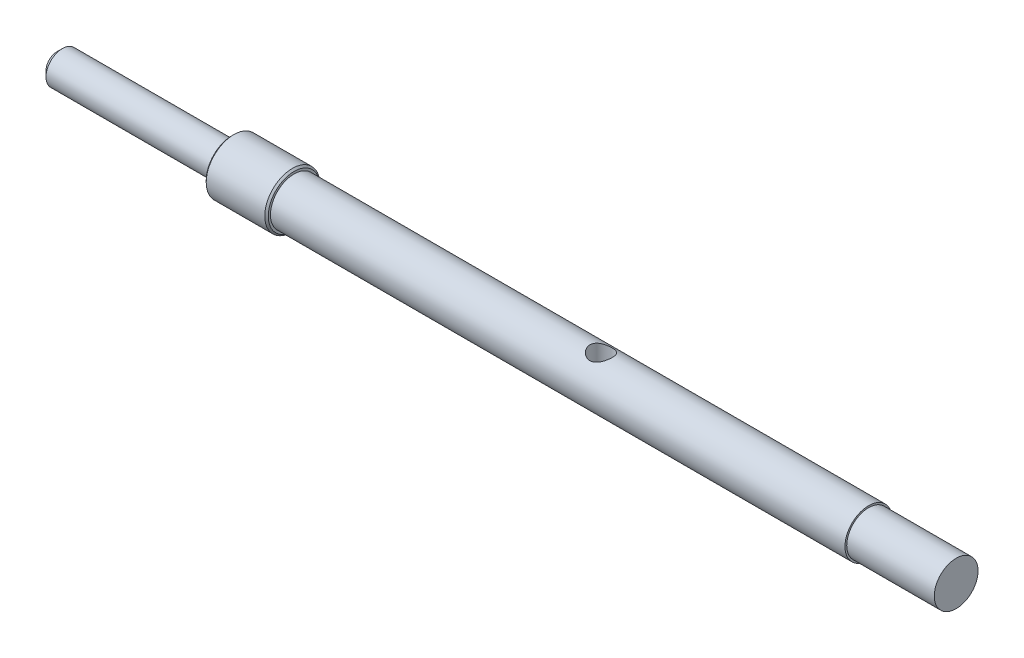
ISO-10303-21;
HEADER;
FILE_DESCRIPTION(('STEP AP214'),'2;1');
FILE_NAME('part.step','',(''),(''),'','','');
FILE_SCHEMA(('AUTOMOTIVE_DESIGN { 1 0 10303 214 1 1 1 1 }'));
ENDSEC;
DATA;
#1=APPLICATION_CONTEXT('core data for automotive mechanical design processes');
#2=APPLICATION_PROTOCOL_DEFINITION('international standard','automotive_design',2000,#1);
#3=PRODUCT_CONTEXT('',#1,'mechanical');
#4=PRODUCT('Part','Part','',(#3));
#5=PRODUCT_RELATED_PRODUCT_CATEGORY('part','',(#4));
#6=PRODUCT_DEFINITION_FORMATION('','',#4);
#7=PRODUCT_DEFINITION_CONTEXT('part definition',#1,'design');
#8=PRODUCT_DEFINITION('design','',#6,#7);
#9=PRODUCT_DEFINITION_SHAPE('','',#8);
#10=(LENGTH_UNIT() NAMED_UNIT(*) SI_UNIT(.MILLI.,.METRE.));
#11=(NAMED_UNIT(*) PLANE_ANGLE_UNIT() SI_UNIT($,.RADIAN.));
#12=(NAMED_UNIT(*) SI_UNIT($,.STERADIAN.) SOLID_ANGLE_UNIT());
#13=UNCERTAINTY_MEASURE_WITH_UNIT(LENGTH_MEASURE(1.E-05),#10,'distance_accuracy_value','');
#14=(GEOMETRIC_REPRESENTATION_CONTEXT(3) GLOBAL_UNCERTAINTY_ASSIGNED_CONTEXT((#13)) GLOBAL_UNIT_ASSIGNED_CONTEXT((#10,
#11,#12)) REPRESENTATION_CONTEXT('',''));
#15=CARTESIAN_POINT('',(0.,0.,0.));
#16=DIRECTION('',(0.,0.,1.));
#17=DIRECTION('',(1.,0.,0.));
#18=AXIS2_PLACEMENT_3D('',#15,#16,#17);
#19=CARTESIAN_POINT('',(0.,2.38125,0.));
#20=DIRECTION('',(1.,0.,0.));
#21=DIRECTION('',(0.,0.,-1.));
#22=AXIS2_PLACEMENT_3D('',#19,#20,#21);
#23=PLANE('',#22);
#24=CARTESIAN_POINT('',(0.,0.,0.));
#25=DIRECTION('',(1.,0.,0.));
#26=DIRECTION('',(0.,0.,-1.));
#27=AXIS2_PLACEMENT_3D('',#24,#25,#26);
#28=CIRCLE('',#27,3.74586500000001);
#29=CARTESIAN_POINT('',(0.,0.,-3.74586500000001));
#30=VERTEX_POINT('',#29);
#31=EDGE_CURVE('E56',#30,#30,#28,.F.);
#32=ORIENTED_EDGE('',*,*,#31,.T.);
#33=EDGE_LOOP('',(#32));
#34=FACE_BOUND('',#33,.T.);
#35=CARTESIAN_POINT('',(0.,0.,0.));
#36=DIRECTION('',(-1.,0.,0.));
#37=DIRECTION('',(0.,0.,1.));
#38=AXIS2_PLACEMENT_3D('',#35,#36,#37);
#39=CIRCLE('',#38,2.38125);
#40=CARTESIAN_POINT('',(0.,0.,2.38125));
#41=VERTEX_POINT('',#40);
#42=EDGE_CURVE('E145',#41,#41,#39,.T.);
#43=ORIENTED_EDGE('',*,*,#42,.F.);
#44=EDGE_LOOP('',(#43));
#45=FACE_BOUND('',#44,.T.);
#46=ADVANCED_FACE('F38',(#34,#45),#23,.F.);
#47=CARTESIAN_POINT('',(0.,0.,0.));
#48=DIRECTION('',(-1.,0.,0.));
#49=DIRECTION('',(0.,0.,1.));
#50=AXIS2_PLACEMENT_3D('',#47,#48,#49);
#51=CYLINDRICAL_SURFACE('',#50,3.999865);
#52=CARTESIAN_POINT('',(8.7460074,0.,0.));
#53=DIRECTION('',(-1.,0.,0.));
#54=DIRECTION('',(0.,0.,1.));
#55=AXIS2_PLACEMENT_3D('',#52,#53,#54);
#56=CIRCLE('',#55,3.999865);
#57=CARTESIAN_POINT('',(8.7460074,0.,3.999865));
#58=VERTEX_POINT('',#57);
#59=EDGE_CURVE('E127',#58,#58,#56,.T.);
#60=ORIENTED_EDGE('',*,*,#59,.T.);
#61=EDGE_LOOP('',(#60));
#62=FACE_BOUND('',#61,.T.);
#63=CARTESIAN_POINT('',(0.253999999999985,0.,0.));
#64=DIRECTION('',(1.,0.,0.));
#65=DIRECTION('',(0.,0.,-1.));
#66=AXIS2_PLACEMENT_3D('',#63,#64,#65);
#67=CIRCLE('',#66,3.999865);
#68=CARTESIAN_POINT('',(0.253999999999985,0.,-3.999865));
#69=VERTEX_POINT('',#68);
#70=EDGE_CURVE('E123',#69,#69,#67,.T.);
#71=ORIENTED_EDGE('',*,*,#70,.T.);
#72=EDGE_LOOP('',(#71));
#73=FACE_BOUND('',#72,.T.);
#74=ADVANCED_FACE('F100',(#62,#73),#51,.T.);
#75=CARTESIAN_POINT('',(9.0000074,3.429,0.));
#76=DIRECTION('',(-1.,0.,0.));
#77=DIRECTION('',(0.,0.,1.));
#78=AXIS2_PLACEMENT_3D('',#75,#76,#77);
#79=PLANE('',#78);
#80=CARTESIAN_POINT('',(9.0000074,0.,0.));
#81=DIRECTION('',(-1.,0.,0.));
#82=DIRECTION('',(0.,0.,1.));
#83=AXIS2_PLACEMENT_3D('',#80,#81,#82);
#84=CIRCLE('',#83,3.745865);
#85=CARTESIAN_POINT('',(9.0000074,0.,3.745865));
#86=VERTEX_POINT('',#85);
#87=EDGE_CURVE('E125',#86,#86,#84,.F.);
#88=ORIENTED_EDGE('',*,*,#87,.T.);
#89=EDGE_LOOP('',(#88));
#90=FACE_BOUND('',#89,.T.);
#91=CARTESIAN_POINT('',(9.0000074,0.,0.));
#92=DIRECTION('',(-1.,0.,0.));
#93=DIRECTION('',(0.,0.,1.));
#94=AXIS2_PLACEMENT_3D('',#91,#92,#93);
#95=CIRCLE('',#94,3.429);
#96=CARTESIAN_POINT('',(9.0000074,0.,3.429));
#97=VERTEX_POINT('',#96);
#98=EDGE_CURVE('E133',#97,#97,#95,.T.);
#99=ORIENTED_EDGE('',*,*,#98,.T.);
#100=EDGE_LOOP('',(#99));
#101=FACE_BOUND('',#100,.T.);
#102=ADVANCED_FACE('F95',(#90,#101),#79,.F.);
#103=CARTESIAN_POINT('',(0.,0.,0.));
#104=DIRECTION('',(-1.,0.,0.));
#105=DIRECTION('',(0.,0.,1.));
#106=AXIS2_PLACEMENT_3D('',#103,#104,#105);
#107=CYLINDRICAL_SURFACE('',#106,3.429);
#108=CARTESIAN_POINT('',(53.5305,-3.02936265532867,1.60655));
#109=CARTESIAN_POINT('',(53.6150042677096,-3.02936843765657,1.60654502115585));
#110=CARTESIAN_POINT('',(53.6996330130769,-3.03295093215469,1.59983925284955));
#111=CARTESIAN_POINT('',(53.8663558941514,-3.04678310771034,1.57332918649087));
#112=CARTESIAN_POINT('',(53.9484435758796,-3.05704850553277,1.5534940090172));
#113=CARTESIAN_POINT('',(54.1073658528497,-3.08280476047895,1.50172545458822));
#114=CARTESIAN_POINT('',(54.1842236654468,-3.0982704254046,1.46985031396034));
#115=CARTESIAN_POINT('',(54.3314821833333,-3.13264616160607,1.39508293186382));
#116=CARTESIAN_POINT('',(54.4018832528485,-3.15155603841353,1.35219131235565));
#117=CARTESIAN_POINT('',(54.5398393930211,-3.19235825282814,1.25298211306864));
#118=CARTESIAN_POINT('',(54.6068251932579,-3.21436728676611,1.19592054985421));
#119=CARTESIAN_POINT('',(54.7307103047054,-3.25794035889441,1.07154449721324));
#120=CARTESIAN_POINT('',(54.7876050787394,-3.279504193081,1.00422542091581));
#121=CARTESIAN_POINT('',(54.8928784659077,-3.32124112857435,0.85651165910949));
#122=CARTESIAN_POINT('',(54.9405803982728,-3.34126325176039,0.775588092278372));
#123=CARTESIAN_POINT('',(55.0214382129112,-3.37618130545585,0.605752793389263));
#124=CARTESIAN_POINT('',(55.0546021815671,-3.39108008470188,0.516845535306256));
#125=CARTESIAN_POINT('',(55.1032652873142,-3.41323754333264,0.339577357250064));
#126=CARTESIAN_POINT('',(55.1197560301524,-3.42092283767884,0.251543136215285));
#127=CARTESIAN_POINT('',(55.1378458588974,-3.42936299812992,0.073646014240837));
#128=CARTESIAN_POINT('',(55.1394527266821,-3.43012148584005,-0.0162159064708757));
#129=CARTESIAN_POINT('',(55.1281668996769,-3.42484464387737,-0.187861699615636));
#130=CARTESIAN_POINT('',(55.1163752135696,-3.4193251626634,-0.269737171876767));
#131=CARTESIAN_POINT('',(55.0805641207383,-3.40286421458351,-0.430188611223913));
#132=CARTESIAN_POINT('',(55.0565438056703,-3.39192234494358,-0.50876433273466));
#133=CARTESIAN_POINT('',(54.9967350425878,-3.36543549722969,-0.661825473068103));
#134=CARTESIAN_POINT('',(54.9607768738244,-3.34982447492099,-0.736232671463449));
#135=CARTESIAN_POINT('',(54.8783133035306,-3.31545402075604,-0.878148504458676));
#136=CARTESIAN_POINT('',(54.8318040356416,-3.29669343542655,-0.94565459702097));
#137=CARTESIAN_POINT('',(54.7249631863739,-3.25593886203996,-1.07800699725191));
#138=CARTESIAN_POINT('',(54.6637893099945,-3.23380556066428,-1.14213124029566));
#139=CARTESIAN_POINT('',(54.5316504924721,-3.18989941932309,-1.25957197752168));
#140=CARTESIAN_POINT('',(54.4606796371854,-3.16812680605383,-1.31288189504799));
#141=CARTESIAN_POINT('',(54.3065318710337,-3.12625940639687,-1.40977736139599));
#142=CARTESIAN_POINT('',(54.2229199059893,-3.10630460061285,-1.45273694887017));
#143=CARTESIAN_POINT('',(54.0484808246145,-3.07214360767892,-1.52366049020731));
#144=CARTESIAN_POINT('',(53.9576604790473,-3.05793210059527,-1.55163832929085));
#145=CARTESIAN_POINT('',(53.7786072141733,-3.03830359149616,-1.58971110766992));
#146=CARTESIAN_POINT('',(53.6906916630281,-3.03230660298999,-1.60099058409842));
#147=CARTESIAN_POINT('',(53.5140383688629,-3.0281233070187,-1.60889310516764));
#148=CARTESIAN_POINT('',(53.4253010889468,-3.02993283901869,-1.60552395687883));
#149=CARTESIAN_POINT('',(53.2580155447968,-3.04054822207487,-1.58531100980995));
#150=CARTESIAN_POINT('',(53.1792700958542,-3.0487084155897,-1.56970978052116));
#151=CARTESIAN_POINT('',(53.0256279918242,-3.07020185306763,-1.52724051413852));
#152=CARTESIAN_POINT('',(52.9507324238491,-3.08353654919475,-1.50036931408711));
#153=CARTESIAN_POINT('',(52.8030258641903,-3.11461009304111,-1.43478728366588));
#154=CARTESIAN_POINT('',(52.7304696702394,-3.1325234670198,-1.39558824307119));
#155=CARTESIAN_POINT('',(52.5925667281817,-3.17054482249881,-1.30690951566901));
#156=CARTESIAN_POINT('',(52.5272235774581,-3.19065388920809,-1.25742473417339));
#157=CARTESIAN_POINT('',(52.3982436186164,-3.23341127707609,-1.14332269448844));
#158=CARTESIAN_POINT('',(52.3355504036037,-3.25609961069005,-1.07764912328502));
#159=CARTESIAN_POINT('',(52.2218279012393,-3.29952957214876,-0.936274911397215));
#160=CARTESIAN_POINT('',(52.1708011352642,-3.32027077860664,-0.860572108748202));
#161=CARTESIAN_POINT('',(52.0812900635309,-3.35791165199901,-0.699570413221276));
#162=CARTESIAN_POINT('',(52.0430087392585,-3.37474796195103,-0.614142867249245));
#163=CARTESIAN_POINT('',(51.9817096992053,-3.40220991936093,-0.437049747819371));
#164=CARTESIAN_POINT('',(51.9586802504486,-3.41284034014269,-0.345389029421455));
#165=CARTESIAN_POINT('',(51.930286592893,-3.4260151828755,-0.166743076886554));
#166=CARTESIAN_POINT('',(51.9236014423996,-3.42916361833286,-0.0800115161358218));
#167=CARTESIAN_POINT('',(51.9243263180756,-3.42882337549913,0.0933680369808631));
#168=CARTESIAN_POINT('',(51.9317325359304,-3.42533649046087,0.180016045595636));
#169=CARTESIAN_POINT('',(51.9595070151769,-3.41246525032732,0.345959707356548));
#170=CARTESIAN_POINT('',(51.9791662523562,-3.40340381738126,0.425401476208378));
#171=CARTESIAN_POINT('',(52.0300077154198,-3.38053268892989,0.579769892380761));
#172=CARTESIAN_POINT('',(52.0611918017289,-3.36672222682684,0.65469580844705));
#173=CARTESIAN_POINT('',(52.1357220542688,-3.3348551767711,0.801681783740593));
#174=CARTESIAN_POINT('',(52.1795549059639,-3.3166346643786,0.873458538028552));
#175=CARTESIAN_POINT('',(52.2774974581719,-3.27796128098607,1.00895170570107));
#176=CARTESIAN_POINT('',(52.331611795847,-3.25750740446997,1.07266446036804));
#177=CARTESIAN_POINT('',(52.4541396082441,-3.21434590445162,1.19610372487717));
#178=CARTESIAN_POINT('',(52.5233924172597,-3.19159836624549,1.25498582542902));
#179=CARTESIAN_POINT('',(52.6713063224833,-3.14805720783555,1.36053156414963));
#180=CARTESIAN_POINT('',(52.7499741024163,-3.12726499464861,1.40718644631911));
#181=CARTESIAN_POINT('',(52.9161753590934,-3.0899497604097,1.48736107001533));
#182=CARTESIAN_POINT('',(53.0038197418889,-3.07349219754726,1.52068297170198));
#183=CARTESIAN_POINT('',(53.1844062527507,-3.04777289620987,1.57161026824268));
#184=CARTESIAN_POINT('',(53.2773294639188,-3.03848701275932,1.58926842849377));
#185=CARTESIAN_POINT('',(53.3975984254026,-3.032159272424,1.6012661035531));
#186=CARTESIAN_POINT('',(53.4241249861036,-3.03111329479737,1.60324521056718));
#187=CARTESIAN_POINT('',(53.4772635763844,-3.02971405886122,1.6058879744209));
#188=CARTESIAN_POINT('',(53.5038756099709,-3.02936083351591,1.60655156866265));
#189=CARTESIAN_POINT('',(53.5305,-3.02936265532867,1.60655));
#190=B_SPLINE_CURVE_WITH_KNOTS('',3,(#108,#109,#110,#111,#112,#113,#114,#115,#116,#117,#118,
#119,#120,#121,#122,#123,#124,#125,#126,#127,#128,#129,#130,#131,#132,#133,#134,#135,#136,#137,
#138,#139,#140,#141,#142,#143,#144,#145,#146,#147,#148,#149,#150,#151,#152,#153,#154,#155,#156,
#157,#158,#159,#160,#161,#162,#163,#164,#165,#166,#167,#168,#169,#170,#171,#172,#173,#174,#175,
#176,#177,#178,#179,#180,#181,#182,#183,#184,#185,#186,#187,#188,#189),.UNSPECIFIED.,.T.,.F.,(4,
2,2,2,2,2,2,2,2,2,2,2,2,2,2,2,2,2,2,2,2,2,2,2,2,2,2,2,2,2,2,2,2,2,2,2,2,2,2,2,4),(0.,
0.253400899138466,0.507399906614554,0.76018575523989,1.01295733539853,1.28391677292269,
1.55499773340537,1.84164591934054,2.12813446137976,2.39635396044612,2.66443321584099,
2.91198191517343,3.15954900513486,3.41079831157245,3.66213983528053,3.93499169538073,
4.20800899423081,4.49479427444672,4.78131329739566,5.04632884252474,5.31120316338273,
5.5521906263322,5.79324576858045,6.04540094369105,6.29768131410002,6.57716241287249,
6.85670385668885,7.1405051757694,7.42408791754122,7.68385880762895,7.94355950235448,
8.18947279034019,8.43542579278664,8.69251350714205,8.94971744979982,9.22955920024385,
9.50960080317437,9.79365603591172,10.0767507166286,10.1565848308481,10.2364227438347),.UNSPECIFIED.);
#191=CARTESIAN_POINT('',(53.5305,-3.02936265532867,1.60655));
#192=VERTEX_POINT('',#191);
#193=EDGE_CURVE('E42',#192,#192,#190,.T.);
#194=ORIENTED_EDGE('',*,*,#193,.T.);
#195=EDGE_LOOP('',(#194));
#196=FACE_BOUND('',#195,.T.);
#197=CARTESIAN_POINT('',(53.5305,3.02936265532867,1.60655));
#198=CARTESIAN_POINT('',(53.4459957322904,3.02936843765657,1.60654502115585));
#199=CARTESIAN_POINT('',(53.3613669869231,3.03295093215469,1.59983925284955));
#200=CARTESIAN_POINT('',(53.1946441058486,3.04678310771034,1.57332918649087));
#201=CARTESIAN_POINT('',(53.1125564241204,3.05704850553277,1.5534940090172));
#202=CARTESIAN_POINT('',(52.9536341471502,3.08280476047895,1.50172545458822));
#203=CARTESIAN_POINT('',(52.8767763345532,3.0982704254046,1.46985031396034));
#204=CARTESIAN_POINT('',(52.7295178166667,3.13264616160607,1.39508293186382));
#205=CARTESIAN_POINT('',(52.6591167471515,3.15155603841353,1.35219131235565));
#206=CARTESIAN_POINT('',(52.5211606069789,3.19235825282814,1.25298211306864));
#207=CARTESIAN_POINT('',(52.454174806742,3.21436728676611,1.19592054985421));
#208=CARTESIAN_POINT('',(52.3302896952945,3.25794035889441,1.07154449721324));
#209=CARTESIAN_POINT('',(52.2733949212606,3.279504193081,1.00422542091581));
#210=CARTESIAN_POINT('',(52.1681215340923,3.32124112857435,0.85651165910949));
#211=CARTESIAN_POINT('',(52.1204196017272,3.34126325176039,0.775588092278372));
#212=CARTESIAN_POINT('',(52.0395617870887,3.37618130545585,0.605752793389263));
#213=CARTESIAN_POINT('',(52.0063978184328,3.39108008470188,0.516845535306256));
#214=CARTESIAN_POINT('',(51.9577347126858,3.41323754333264,0.339577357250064));
#215=CARTESIAN_POINT('',(51.9412439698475,3.42092283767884,0.251543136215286));
#216=CARTESIAN_POINT('',(51.9231541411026,3.42936299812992,0.0736460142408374));
#217=CARTESIAN_POINT('',(51.9215472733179,3.43012148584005,-0.0162159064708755));
#218=CARTESIAN_POINT('',(51.9328331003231,3.42484464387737,-0.187861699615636));
#219=CARTESIAN_POINT('',(51.9446247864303,3.4193251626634,-0.269737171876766));
#220=CARTESIAN_POINT('',(51.9804358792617,3.40286421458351,-0.430188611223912));
#221=CARTESIAN_POINT('',(52.0044561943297,3.39192234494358,-0.508764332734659));
#222=CARTESIAN_POINT('',(52.0642649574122,3.36543549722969,-0.661825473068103));
#223=CARTESIAN_POINT('',(52.1002231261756,3.34982447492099,-0.736232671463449));
#224=CARTESIAN_POINT('',(52.1826866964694,3.31545402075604,-0.878148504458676));
#225=CARTESIAN_POINT('',(52.2291959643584,3.29669343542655,-0.94565459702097));
#226=CARTESIAN_POINT('',(52.3360368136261,3.25593886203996,-1.07800699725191));
#227=CARTESIAN_POINT('',(52.3972106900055,3.23380556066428,-1.14213124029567));
#228=CARTESIAN_POINT('',(52.5293495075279,3.18989941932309,-1.25957197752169));
#229=CARTESIAN_POINT('',(52.6003203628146,3.16812680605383,-1.312881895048));
#230=CARTESIAN_POINT('',(52.7544681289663,3.12625940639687,-1.40977736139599));
#231=CARTESIAN_POINT('',(52.8380800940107,3.10630460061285,-1.45273694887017));
#232=CARTESIAN_POINT('',(53.0125191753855,3.07214360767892,-1.52366049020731));
#233=CARTESIAN_POINT('',(53.1033395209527,3.05793210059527,-1.55163832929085));
#234=CARTESIAN_POINT('',(53.2823927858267,3.03830359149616,-1.58971110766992));
#235=CARTESIAN_POINT('',(53.3703083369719,3.03230660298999,-1.60099058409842));
#236=CARTESIAN_POINT('',(53.5469616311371,3.0281233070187,-1.60889310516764));
#237=CARTESIAN_POINT('',(53.6356989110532,3.02993283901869,-1.60552395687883));
#238=CARTESIAN_POINT('',(53.8029844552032,3.04054822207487,-1.58531100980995));
#239=CARTESIAN_POINT('',(53.8817299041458,3.0487084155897,-1.56970978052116));
#240=CARTESIAN_POINT('',(54.0353720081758,3.07020185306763,-1.52724051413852));
#241=CARTESIAN_POINT('',(54.1102675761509,3.08353654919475,-1.50036931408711));
#242=CARTESIAN_POINT('',(54.2579741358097,3.11461009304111,-1.43478728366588));
#243=CARTESIAN_POINT('',(54.3305303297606,3.1325234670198,-1.39558824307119));
#244=CARTESIAN_POINT('',(54.4684332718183,3.17054482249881,-1.30690951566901));
#245=CARTESIAN_POINT('',(54.5337764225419,3.19065388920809,-1.25742473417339));
#246=CARTESIAN_POINT('',(54.6627563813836,3.23341127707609,-1.14332269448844));
#247=CARTESIAN_POINT('',(54.7254495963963,3.25609961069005,-1.07764912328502));
#248=CARTESIAN_POINT('',(54.8391720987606,3.29952957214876,-0.936274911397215));
#249=CARTESIAN_POINT('',(54.8901988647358,3.32027077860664,-0.860572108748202));
#250=CARTESIAN_POINT('',(54.9797099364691,3.35791165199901,-0.699570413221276));
#251=CARTESIAN_POINT('',(55.0179912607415,3.37474796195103,-0.614142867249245));
#252=CARTESIAN_POINT('',(55.0792903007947,3.40220991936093,-0.437049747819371));
#253=CARTESIAN_POINT('',(55.1023197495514,3.41284034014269,-0.345389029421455));
#254=CARTESIAN_POINT('',(55.130713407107,3.4260151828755,-0.166743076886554));
#255=CARTESIAN_POINT('',(55.1373985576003,3.42916361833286,-0.0800115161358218));
#256=CARTESIAN_POINT('',(55.1366736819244,3.42882337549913,0.0933680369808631));
#257=CARTESIAN_POINT('',(55.1292674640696,3.42533649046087,0.180016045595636));
#258=CARTESIAN_POINT('',(55.1014929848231,3.41246525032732,0.345959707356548));
#259=CARTESIAN_POINT('',(55.0818337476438,3.40340381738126,0.425401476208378));
#260=CARTESIAN_POINT('',(55.0309922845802,3.38053268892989,0.579769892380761));
#261=CARTESIAN_POINT('',(54.9998081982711,3.36672222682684,0.65469580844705));
#262=CARTESIAN_POINT('',(54.9252779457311,3.3348551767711,0.801681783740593));
#263=CARTESIAN_POINT('',(54.8814450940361,3.3166346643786,0.873458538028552));
#264=CARTESIAN_POINT('',(54.7835025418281,3.27796128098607,1.00895170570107));
#265=CARTESIAN_POINT('',(54.729388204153,3.25750740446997,1.07266446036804));
#266=CARTESIAN_POINT('',(54.6068603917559,3.21434590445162,1.19610372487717));
#267=CARTESIAN_POINT('',(54.5376075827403,3.19159836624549,1.25498582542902));
#268=CARTESIAN_POINT('',(54.3896936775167,3.14805720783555,1.36053156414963));
#269=CARTESIAN_POINT('',(54.3110258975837,3.12726499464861,1.40718644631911));
#270=CARTESIAN_POINT('',(54.1448246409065,3.0899497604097,1.48736107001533));
#271=CARTESIAN_POINT('',(54.0571802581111,3.07349219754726,1.52068297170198));
#272=CARTESIAN_POINT('',(53.8765937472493,3.04777289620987,1.57161026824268));
#273=CARTESIAN_POINT('',(53.7836705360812,3.03848701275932,1.58926842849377));
#274=CARTESIAN_POINT('',(53.6634015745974,3.032159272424,1.6012661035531));
#275=CARTESIAN_POINT('',(53.6368750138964,3.03111329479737,1.60324521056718));
#276=CARTESIAN_POINT('',(53.5837364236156,3.02971405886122,1.6058879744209));
#277=CARTESIAN_POINT('',(53.5571243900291,3.02936083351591,1.60655156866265));
#278=CARTESIAN_POINT('',(53.5305,3.02936265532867,1.60655));
#279=B_SPLINE_CURVE_WITH_KNOTS('',3,(#197,#198,#199,#200,#201,#202,#203,#204,#205,#206,#207,
#208,#209,#210,#211,#212,#213,#214,#215,#216,#217,#218,#219,#220,#221,#222,#223,#224,#225,#226,
#227,#228,#229,#230,#231,#232,#233,#234,#235,#236,#237,#238,#239,#240,#241,#242,#243,#244,#245,
#246,#247,#248,#249,#250,#251,#252,#253,#254,#255,#256,#257,#258,#259,#260,#261,#262,#263,#264,
#265,#266,#267,#268,#269,#270,#271,#272,#273,#274,#275,#276,#277,#278),.UNSPECIFIED.,.T.,.F.,(4,
2,2,2,2,2,2,2,2,2,2,2,2,2,2,2,2,2,2,2,2,2,2,2,2,2,2,2,2,2,2,2,2,2,2,2,2,2,2,2,4),(0.,
0.253400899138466,0.507399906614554,0.76018575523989,1.01295733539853,1.28391677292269,
1.55499773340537,1.84164591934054,2.12813446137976,2.39635396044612,2.66443321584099,
2.91198191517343,3.15954900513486,3.41079831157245,3.66213983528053,3.93499169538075,
4.20800899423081,4.49479427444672,4.78131329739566,5.04632884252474,5.31120316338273,
5.5521906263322,5.79324576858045,6.04540094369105,6.29768131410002,6.57716241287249,
6.85670385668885,7.1405051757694,7.42408791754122,7.68385880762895,7.94355950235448,
8.18947279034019,8.43542579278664,8.69251350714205,8.94971744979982,9.22955920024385,
9.50960080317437,9.79365603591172,10.0767507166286,10.1565848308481,10.2364227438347),.UNSPECIFIED.);
#280=CARTESIAN_POINT('',(53.5305,3.02936265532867,1.60655));
#281=VERTEX_POINT('',#280);
#282=EDGE_CURVE('E59',#281,#281,#279,.T.);
#283=ORIENTED_EDGE('',*,*,#282,.T.);
#284=EDGE_LOOP('',(#283));
#285=FACE_BOUND('',#284,.T.);
#286=ORIENTED_EDGE('',*,*,#98,.F.);
#287=EDGE_LOOP('',(#286));
#288=FACE_BOUND('',#287,.T.);
#289=CARTESIAN_POINT('',(92.3437574,0.,0.));
#290=DIRECTION('',(-1.,0.,0.));
#291=DIRECTION('',(0.,0.,1.));
#292=AXIS2_PLACEMENT_3D('',#289,#290,#291);
#293=CIRCLE('',#292,3.429);
#294=CARTESIAN_POINT('',(92.3437574,0.,3.429));
#295=VERTEX_POINT('',#294);
#296=EDGE_CURVE('E136',#295,#295,#293,.T.);
#297=ORIENTED_EDGE('',*,*,#296,.T.);
#298=EDGE_LOOP('',(#297));
#299=FACE_BOUND('',#298,.T.);
#300=ADVANCED_FACE('F64',(#196,#285,#288,#299),#107,.T.);
#301=CARTESIAN_POINT('',(92.3437574,3.429,0.));
#302=DIRECTION('',(-1.,0.,0.));
#303=DIRECTION('',(0.,0.,1.));
#304=AXIS2_PLACEMENT_3D('',#301,#302,#303);
#305=PLANE('',#304);
#306=ORIENTED_EDGE('',*,*,#296,.F.);
#307=EDGE_LOOP('',(#306));
#308=FACE_BOUND('',#307,.T.);
#309=CARTESIAN_POINT('',(92.3437574,0.,0.));
#310=DIRECTION('',(-1.,0.,0.));
#311=DIRECTION('',(0.,0.,1.));
#312=AXIS2_PLACEMENT_3D('',#309,#310,#311);
#313=CIRCLE('',#312,3.175);
#314=CARTESIAN_POINT('',(92.3437574,0.,3.175));
#315=VERTEX_POINT('',#314);
#316=EDGE_CURVE('E139',#315,#315,#313,.T.);
#317=ORIENTED_EDGE('',*,*,#316,.T.);
#318=EDGE_LOOP('',(#317));
#319=FACE_BOUND('',#318,.T.);
#320=ADVANCED_FACE('F88',(#308,#319),#305,.F.);
#321=CARTESIAN_POINT('',(0.,0.,0.));
#322=DIRECTION('',(-1.,0.,0.));
#323=DIRECTION('',(0.,0.,1.));
#324=AXIS2_PLACEMENT_3D('',#321,#322,#323);
#325=CYLINDRICAL_SURFACE('',#324,3.175);
#326=ORIENTED_EDGE('',*,*,#316,.F.);
#327=EDGE_LOOP('',(#326));
#328=FACE_BOUND('',#327,.T.);
#329=CARTESIAN_POINT('',(105.0437574,0.,0.));
#330=DIRECTION('',(-1.,0.,0.));
#331=DIRECTION('',(0.,0.,1.));
#332=AXIS2_PLACEMENT_3D('',#329,#330,#331);
#333=CIRCLE('',#332,3.175);
#334=CARTESIAN_POINT('',(105.0437574,0.,3.175));
#335=VERTEX_POINT('',#334);
#336=EDGE_CURVE('E142',#335,#335,#333,.T.);
#337=ORIENTED_EDGE('',*,*,#336,.T.);
#338=EDGE_LOOP('',(#337));
#339=FACE_BOUND('',#338,.T.);
#340=ADVANCED_FACE('F85',(#328,#339),#325,.T.);
#341=CARTESIAN_POINT('',(105.0437574,3.175,0.));
#342=DIRECTION('',(-1.,0.,0.));
#343=DIRECTION('',(0.,0.,1.));
#344=AXIS2_PLACEMENT_3D('',#341,#342,#343);
#345=PLANE('',#344);
#346=ORIENTED_EDGE('',*,*,#336,.F.);
#347=EDGE_LOOP('',(#346));
#348=FACE_BOUND('',#347,.T.);
#349=ADVANCED_FACE('F81',(#348),#345,.F.);
#350=CARTESIAN_POINT('',(-25.4,2.38125,0.));
#351=DIRECTION('',(1.,0.,0.));
#352=DIRECTION('',(0.,0.,-1.));
#353=AXIS2_PLACEMENT_3D('',#350,#351,#352);
#354=PLANE('',#353);
#355=CARTESIAN_POINT('',(-25.4,0.,0.));
#356=DIRECTION('',(1.,0.,0.));
#357=DIRECTION('',(0.,0.,-1.));
#358=AXIS2_PLACEMENT_3D('',#355,#356,#357);
#359=CIRCLE('',#358,1.58750000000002);
#360=CARTESIAN_POINT('',(-25.4,0.,-1.58750000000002));
#361=VERTEX_POINT('',#360);
#362=EDGE_CURVE('E51',#361,#361,#359,.F.);
#363=ORIENTED_EDGE('',*,*,#362,.T.);
#364=EDGE_LOOP('',(#363));
#365=FACE_BOUND('',#364,.T.);
#366=ADVANCED_FACE('F78',(#365),#354,.F.);
#367=CARTESIAN_POINT('',(0.,0.,0.));
#368=DIRECTION('',(-1.,0.,0.));
#369=DIRECTION('',(0.,0.,1.));
#370=AXIS2_PLACEMENT_3D('',#367,#368,#369);
#371=CYLINDRICAL_SURFACE('',#370,2.38125);
#372=CARTESIAN_POINT('',(-24.60625,0.,0.));
#373=DIRECTION('',(1.,0.,0.));
#374=DIRECTION('',(0.,0.,-1.));
#375=AXIS2_PLACEMENT_3D('',#372,#373,#374);
#376=CIRCLE('',#375,2.38125);
#377=CARTESIAN_POINT('',(-24.60625,0.,-2.38125));
#378=VERTEX_POINT('',#377);
#379=EDGE_CURVE('E10',#378,#378,#376,.T.);
#380=ORIENTED_EDGE('',*,*,#379,.T.);
#381=EDGE_LOOP('',(#380));
#382=FACE_BOUND('',#381,.T.);
#383=ORIENTED_EDGE('',*,*,#42,.T.);
#384=EDGE_LOOP('',(#383));
#385=FACE_BOUND('',#384,.T.);
#386=ADVANCED_FACE('F73',(#382,#385),#371,.T.);
#387=CARTESIAN_POINT('',(8.7460074,0.,0.));
#388=DIRECTION('',(-1.,0.,0.));
#389=DIRECTION('',(0.,0.,1.));
#390=AXIS2_PLACEMENT_3D('',#387,#388,#389);
#391=CONICAL_SURFACE('',#390,3.999865,0.785398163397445);
#392=ORIENTED_EDGE('',*,*,#87,.F.);
#393=EDGE_LOOP('',(#392));
#394=FACE_BOUND('',#393,.T.);
#395=ORIENTED_EDGE('',*,*,#59,.F.);
#396=EDGE_LOOP('',(#395));
#397=FACE_BOUND('',#396,.T.);
#398=ADVANCED_FACE('F77',(#394,#397),#391,.T.);
#399=CARTESIAN_POINT('',(0.,0.,0.));
#400=DIRECTION('',(1.,0.,0.));
#401=DIRECTION('',(0.,0.,-1.));
#402=AXIS2_PLACEMENT_3D('',#399,#400,#401);
#403=CONICAL_SURFACE('',#402,3.74586500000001,0.785398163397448);
#404=ORIENTED_EDGE('',*,*,#70,.F.);
#405=EDGE_LOOP('',(#404));
#406=FACE_BOUND('',#405,.T.);
#407=ORIENTED_EDGE('',*,*,#31,.F.);
#408=EDGE_LOOP('',(#407));
#409=FACE_BOUND('',#408,.T.);
#410=ADVANCED_FACE('F112',(#406,#409),#403,.T.);
#411=CARTESIAN_POINT('',(-25.4,0.,0.));
#412=DIRECTION('',(1.,0.,0.));
#413=DIRECTION('',(0.,0.,-1.));
#414=AXIS2_PLACEMENT_3D('',#411,#412,#413);
#415=CONICAL_SURFACE('',#414,1.58750000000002,0.785398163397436);
#416=ORIENTED_EDGE('',*,*,#379,.F.);
#417=EDGE_LOOP('',(#416));
#418=FACE_BOUND('',#417,.T.);
#419=ORIENTED_EDGE('',*,*,#362,.F.);
#420=EDGE_LOOP('',(#419));
#421=FACE_BOUND('',#420,.T.);
#422=ADVANCED_FACE('F40',(#418,#421),#415,.T.);
#423=CARTESIAN_POINT('',(53.5305,-3.999865,0.));
#424=DIRECTION('',(0.,1.,0.));
#425=DIRECTION('',(0.,0.,1.));
#426=AXIS2_PLACEMENT_3D('',#423,#424,#425);
#427=CYLINDRICAL_SURFACE('',#426,1.60655);
#428=ORIENTED_EDGE('',*,*,#282,.F.);
#429=EDGE_LOOP('',(#428));
#430=FACE_BOUND('',#429,.T.);
#431=ORIENTED_EDGE('',*,*,#193,.F.);
#432=EDGE_LOOP('',(#431));
#433=FACE_BOUND('',#432,.T.);
#434=ADVANCED_FACE('F68',(#430,#433),#427,.F.);
#435=CLOSED_SHELL('',(#46,#74,#102,#300,#320,#340,#349,#366,#386,#398,#410,#422,#434));
#436=MANIFOLD_SOLID_BREP('B2',#435);
#437=ADVANCED_BREP_SHAPE_REPRESENTATION('',(#18,#436),#14);
#438=SHAPE_DEFINITION_REPRESENTATION(#9,#437);
ENDSEC;
END-ISO-10303-21;
